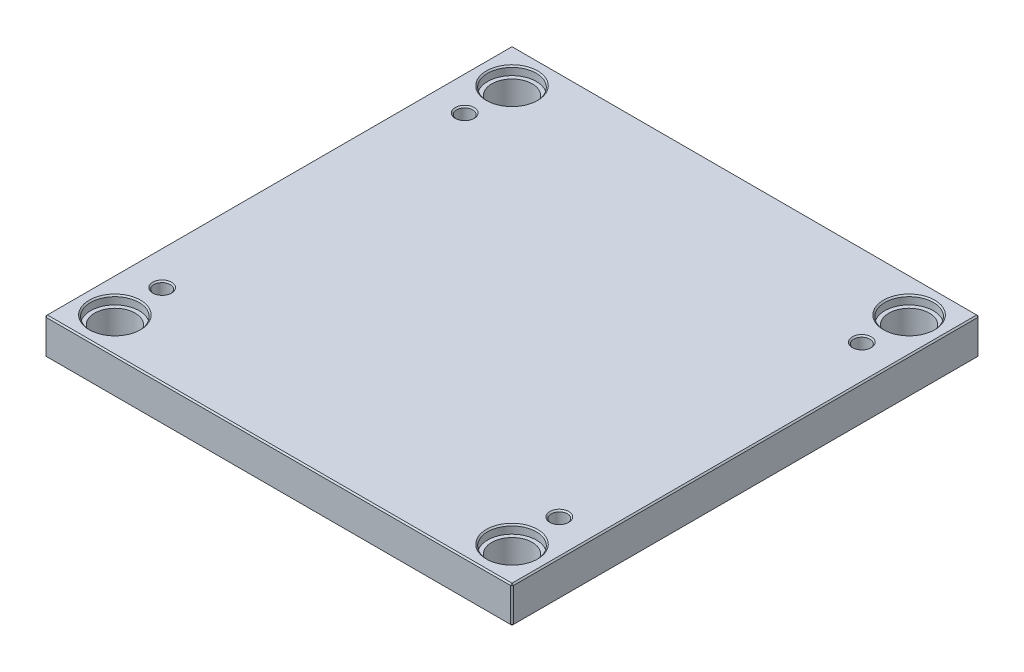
ISO-10303-21;
HEADER;
FILE_DESCRIPTION(('STEP AP214'),'2;1');
FILE_NAME('part.step','',(''),(''),'','','');
FILE_SCHEMA(('AUTOMOTIVE_DESIGN { 1 0 10303 214 1 1 1 1 }'));
ENDSEC;
DATA;
#1=APPLICATION_CONTEXT('core data for automotive mechanical design processes');
#2=APPLICATION_PROTOCOL_DEFINITION('international standard','automotive_design',2000,#1);
#3=PRODUCT_CONTEXT('',#1,'mechanical');
#4=PRODUCT('Part','Part','',(#3));
#5=PRODUCT_RELATED_PRODUCT_CATEGORY('part','',(#4));
#6=PRODUCT_DEFINITION_FORMATION('','',#4);
#7=PRODUCT_DEFINITION_CONTEXT('part definition',#1,'design');
#8=PRODUCT_DEFINITION('design','',#6,#7);
#9=PRODUCT_DEFINITION_SHAPE('','',#8);
#10=(LENGTH_UNIT() NAMED_UNIT(*) SI_UNIT(.MILLI.,.METRE.));
#11=(NAMED_UNIT(*) PLANE_ANGLE_UNIT() SI_UNIT($,.RADIAN.));
#12=(NAMED_UNIT(*) SI_UNIT($,.STERADIAN.) SOLID_ANGLE_UNIT());
#13=UNCERTAINTY_MEASURE_WITH_UNIT(LENGTH_MEASURE(1.E-05),#10,'distance_accuracy_value','');
#14=(GEOMETRIC_REPRESENTATION_CONTEXT(3) GLOBAL_UNCERTAINTY_ASSIGNED_CONTEXT((#13)) GLOBAL_UNIT_ASSIGNED_CONTEXT((#10,
#11,#12)) REPRESENTATION_CONTEXT('',''));
#15=CARTESIAN_POINT('',(0.,0.,0.));
#16=DIRECTION('',(0.,0.,1.));
#17=DIRECTION('',(1.,0.,0.));
#18=AXIS2_PLACEMENT_3D('',#15,#16,#17);
#19=CARTESIAN_POINT('',(-147.,0.,-147.));
#20=DIRECTION('',(0.,1.,0.));
#21=DIRECTION('',(0.,0.,1.));
#22=AXIS2_PLACEMENT_3D('',#19,#20,#21);
#23=CYLINDRICAL_SURFACE('',#22,15.);
#24=CARTESIAN_POINT('',(-147.,0.999999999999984,-147.));
#25=DIRECTION('',(0.,1.,0.));
#26=DIRECTION('',(0.,0.,1.));
#27=AXIS2_PLACEMENT_3D('',#24,#25,#26);
#28=CIRCLE('',#27,15.);
#29=CARTESIAN_POINT('',(-147.,0.999999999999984,-132.));
#30=VERTEX_POINT('',#29);
#31=EDGE_CURVE('E472',#30,#30,#28,.F.);
#32=ORIENTED_EDGE('',*,*,#31,.T.);
#33=EDGE_LOOP('',(#32));
#34=FACE_BOUND('',#33,.T.);
#35=CARTESIAN_POINT('',(-147.,20.7,-147.));
#36=DIRECTION('',(0.,1.,0.));
#37=DIRECTION('',(0.,0.,1.));
#38=AXIS2_PLACEMENT_3D('',#35,#36,#37);
#39=CIRCLE('',#38,15.);
#40=CARTESIAN_POINT('',(-147.,20.7,-132.));
#41=VERTEX_POINT('',#40);
#42=EDGE_CURVE('E221',#41,#41,#39,.F.);
#43=ORIENTED_EDGE('',*,*,#42,.F.);
#44=EDGE_LOOP('',(#43));
#45=FACE_BOUND('',#44,.T.);
#46=ADVANCED_FACE('F16',(#34,#45),#23,.F.);
#47=CARTESIAN_POINT('',(147.,0.,-147.));
#48=DIRECTION('',(0.,1.,0.));
#49=DIRECTION('',(0.,0.,1.));
#50=AXIS2_PLACEMENT_3D('',#47,#48,#49);
#51=CYLINDRICAL_SURFACE('',#50,15.);
#52=CARTESIAN_POINT('',(147.,0.999999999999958,-147.));
#53=DIRECTION('',(0.,1.,0.));
#54=DIRECTION('',(0.,0.,1.));
#55=AXIS2_PLACEMENT_3D('',#52,#53,#54);
#56=CIRCLE('',#55,15.);
#57=CARTESIAN_POINT('',(147.,0.999999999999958,-132.));
#58=VERTEX_POINT('',#57);
#59=EDGE_CURVE('E474',#58,#58,#56,.F.);
#60=ORIENTED_EDGE('',*,*,#59,.T.);
#61=EDGE_LOOP('',(#60));
#62=FACE_BOUND('',#61,.T.);
#63=CARTESIAN_POINT('',(147.,20.7,-147.));
#64=DIRECTION('',(0.,1.,0.));
#65=DIRECTION('',(0.,0.,1.));
#66=AXIS2_PLACEMENT_3D('',#63,#64,#65);
#67=CIRCLE('',#66,15.);
#68=CARTESIAN_POINT('',(147.,20.7,-132.));
#69=VERTEX_POINT('',#68);
#70=EDGE_CURVE('E218',#69,#69,#67,.F.);
#71=ORIENTED_EDGE('',*,*,#70,.F.);
#72=EDGE_LOOP('',(#71));
#73=FACE_BOUND('',#72,.T.);
#74=ADVANCED_FACE('F263',(#62,#73),#51,.F.);
#75=CARTESIAN_POINT('',(147.,0.,147.));
#76=DIRECTION('',(0.,1.,0.));
#77=DIRECTION('',(0.,0.,1.));
#78=AXIS2_PLACEMENT_3D('',#75,#76,#77);
#79=CYLINDRICAL_SURFACE('',#78,15.);
#80=CARTESIAN_POINT('',(147.,0.999999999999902,147.));
#81=DIRECTION('',(0.,1.,0.));
#82=DIRECTION('',(0.,0.,1.));
#83=AXIS2_PLACEMENT_3D('',#80,#81,#82);
#84=CIRCLE('',#83,15.);
#85=CARTESIAN_POINT('',(147.,0.999999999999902,162.));
#86=VERTEX_POINT('',#85);
#87=EDGE_CURVE('E477',#86,#86,#84,.F.);
#88=ORIENTED_EDGE('',*,*,#87,.T.);
#89=EDGE_LOOP('',(#88));
#90=FACE_BOUND('',#89,.T.);
#91=CARTESIAN_POINT('',(147.,20.7,147.));
#92=DIRECTION('',(0.,1.,0.));
#93=DIRECTION('',(0.,0.,1.));
#94=AXIS2_PLACEMENT_3D('',#91,#92,#93);
#95=CIRCLE('',#94,15.);
#96=CARTESIAN_POINT('',(147.,20.7,162.));
#97=VERTEX_POINT('',#96);
#98=EDGE_CURVE('E214',#97,#97,#95,.F.);
#99=ORIENTED_EDGE('',*,*,#98,.F.);
#100=EDGE_LOOP('',(#99));
#101=FACE_BOUND('',#100,.T.);
#102=ADVANCED_FACE('F270',(#90,#101),#79,.F.);
#103=CARTESIAN_POINT('',(-147.,0.,147.));
#104=DIRECTION('',(0.,1.,0.));
#105=DIRECTION('',(0.,0.,1.));
#106=AXIS2_PLACEMENT_3D('',#103,#104,#105);
#107=CYLINDRICAL_SURFACE('',#106,15.);
#108=CARTESIAN_POINT('',(-147.,0.999999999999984,147.));
#109=DIRECTION('',(0.,1.,0.));
#110=DIRECTION('',(0.,0.,1.));
#111=AXIS2_PLACEMENT_3D('',#108,#109,#110);
#112=CIRCLE('',#111,15.);
#113=CARTESIAN_POINT('',(-147.,0.999999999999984,162.));
#114=VERTEX_POINT('',#113);
#115=EDGE_CURVE('E480',#114,#114,#112,.F.);
#116=ORIENTED_EDGE('',*,*,#115,.T.);
#117=EDGE_LOOP('',(#116));
#118=FACE_BOUND('',#117,.T.);
#119=CARTESIAN_POINT('',(-147.,20.7,147.));
#120=DIRECTION('',(0.,1.,0.));
#121=DIRECTION('',(0.,0.,1.));
#122=AXIS2_PLACEMENT_3D('',#119,#120,#121);
#123=CIRCLE('',#122,15.);
#124=CARTESIAN_POINT('',(-147.,20.7,162.));
#125=VERTEX_POINT('',#124);
#126=EDGE_CURVE('E211',#125,#125,#123,.F.);
#127=ORIENTED_EDGE('',*,*,#126,.F.);
#128=EDGE_LOOP('',(#127));
#129=FACE_BOUND('',#128,.T.);
#130=ADVANCED_FACE('F277',(#118,#129),#107,.F.);
#131=CARTESIAN_POINT('',(-173.,27.,173.));
#132=DIRECTION('',(1.,0.,0.));
#133=DIRECTION('',(0.,0.,-1.));
#134=AXIS2_PLACEMENT_3D('',#131,#132,#133);
#135=PLANE('',#134);
#136=DIRECTION('',(0.,-1.,0.));
#137=VECTOR('',#136,1.);
#138=CARTESIAN_POINT('',(-173.,27.,-172.));
#139=LINE('',#138,#137);
#140=CARTESIAN_POINT('',(-173.,26.,-172.));
#141=VERTEX_POINT('',#140);
#142=CARTESIAN_POINT('',(-173.,0.999999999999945,-172.));
#143=VERTEX_POINT('',#142);
#144=EDGE_CURVE('E487',#141,#143,#139,.T.);
#145=ORIENTED_EDGE('',*,*,#144,.T.);
#146=DIRECTION('',(0.,0.,1.));
#147=VECTOR('',#146,1.);
#148=CARTESIAN_POINT('',(-173.,0.999999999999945,173.));
#149=LINE('',#148,#147);
#150=CARTESIAN_POINT('',(-173.,0.999999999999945,172.));
#151=VERTEX_POINT('',#150);
#152=EDGE_CURVE('E490',#143,#151,#149,.T.);
#153=ORIENTED_EDGE('',*,*,#152,.T.);
#154=DIRECTION('',(0.,1.,0.));
#155=VECTOR('',#154,1.);
#156=CARTESIAN_POINT('',(-173.,27.,172.));
#157=LINE('',#156,#155);
#158=CARTESIAN_POINT('',(-173.,26.,172.));
#159=VERTEX_POINT('',#158);
#160=EDGE_CURVE('E485',#151,#159,#157,.T.);
#161=ORIENTED_EDGE('',*,*,#160,.T.);
#162=DIRECTION('',(0.,0.,-1.));
#163=VECTOR('',#162,1.);
#164=CARTESIAN_POINT('',(-173.,26.,-173.));
#165=LINE('',#164,#163);
#166=EDGE_CURVE('E483',#159,#141,#165,.T.);
#167=ORIENTED_EDGE('',*,*,#166,.T.);
#168=EDGE_LOOP('',(#145,#153,#161,#167));
#169=FACE_BOUND('',#168,.T.);
#170=ADVANCED_FACE('F298',(#169),#135,.F.);
#171=CARTESIAN_POINT('',(173.,27.,173.));
#172=DIRECTION('',(0.,0.,-1.));
#173=DIRECTION('',(-1.,0.,0.));
#174=AXIS2_PLACEMENT_3D('',#171,#172,#173);
#175=PLANE('',#174);
#176=DIRECTION('',(-1.,0.,0.));
#177=VECTOR('',#176,1.);
#178=CARTESIAN_POINT('',(-173.,26.,173.));
#179=LINE('',#178,#177);
#180=CARTESIAN_POINT('',(172.,26.,173.));
#181=VERTEX_POINT('',#180);
#182=CARTESIAN_POINT('',(-172.,26.,173.));
#183=VERTEX_POINT('',#182);
#184=EDGE_CURVE('E509',#181,#183,#179,.T.);
#185=ORIENTED_EDGE('',*,*,#184,.T.);
#186=DIRECTION('',(0.,-1.,0.));
#187=VECTOR('',#186,1.);
#188=CARTESIAN_POINT('',(-172.,27.,173.));
#189=LINE('',#188,#187);
#190=CARTESIAN_POINT('',(-172.,1.,173.));
#191=VERTEX_POINT('',#190);
#192=EDGE_CURVE('E515',#183,#191,#189,.T.);
#193=ORIENTED_EDGE('',*,*,#192,.T.);
#194=DIRECTION('',(1.,0.,0.));
#195=VECTOR('',#194,1.);
#196=CARTESIAN_POINT('',(173.,1.,173.));
#197=LINE('',#196,#195);
#198=CARTESIAN_POINT('',(172.,1.,173.));
#199=VERTEX_POINT('',#198);
#200=EDGE_CURVE('E513',#191,#199,#197,.T.);
#201=ORIENTED_EDGE('',*,*,#200,.T.);
#202=DIRECTION('',(0.,1.,0.));
#203=VECTOR('',#202,1.);
#204=CARTESIAN_POINT('',(172.,27.,173.));
#205=LINE('',#204,#203);
#206=EDGE_CURVE('E511',#199,#181,#205,.T.);
#207=ORIENTED_EDGE('',*,*,#206,.T.);
#208=EDGE_LOOP('',(#185,#193,#201,#207));
#209=FACE_BOUND('',#208,.T.);
#210=ADVANCED_FACE('F294',(#209),#175,.F.);
#211=CARTESIAN_POINT('',(173.,27.,173.));
#212=DIRECTION('',(-1.,0.,0.));
#213=DIRECTION('',(0.,0.,1.));
#214=AXIS2_PLACEMENT_3D('',#211,#212,#213);
#215=PLANE('',#214);
#216=DIRECTION('',(0.,0.,-1.));
#217=VECTOR('',#216,1.);
#218=CARTESIAN_POINT('',(173.,1.,173.));
#219=LINE('',#218,#217);
#220=CARTESIAN_POINT('',(173.,1.,172.));
#221=VERTEX_POINT('',#220);
#222=CARTESIAN_POINT('',(173.,1.,-172.));
#223=VERTEX_POINT('',#222);
#224=EDGE_CURVE('E504',#221,#223,#219,.T.);
#225=ORIENTED_EDGE('',*,*,#224,.T.);
#226=DIRECTION('',(0.,1.,0.));
#227=VECTOR('',#226,1.);
#228=CARTESIAN_POINT('',(173.,27.,-172.));
#229=LINE('',#228,#227);
#230=CARTESIAN_POINT('',(173.,26.,-172.));
#231=VERTEX_POINT('',#230);
#232=EDGE_CURVE('E506',#223,#231,#229,.T.);
#233=ORIENTED_EDGE('',*,*,#232,.T.);
#234=DIRECTION('',(0.,0.,1.));
#235=VECTOR('',#234,1.);
#236=CARTESIAN_POINT('',(173.,26.,173.));
#237=LINE('',#236,#235);
#238=CARTESIAN_POINT('',(173.,26.,172.));
#239=VERTEX_POINT('',#238);
#240=EDGE_CURVE('E500',#231,#239,#237,.T.);
#241=ORIENTED_EDGE('',*,*,#240,.T.);
#242=DIRECTION('',(0.,-1.,0.));
#243=VECTOR('',#242,1.);
#244=CARTESIAN_POINT('',(173.,27.,172.));
#245=LINE('',#244,#243);
#246=EDGE_CURVE('E502',#239,#221,#245,.T.);
#247=ORIENTED_EDGE('',*,*,#246,.T.);
#248=EDGE_LOOP('',(#225,#233,#241,#247));
#249=FACE_BOUND('',#248,.T.);
#250=ADVANCED_FACE('F290',(#249),#215,.F.);
#251=CARTESIAN_POINT('',(173.,27.,-173.));
#252=DIRECTION('',(0.,0.,1.));
#253=DIRECTION('',(1.,0.,0.));
#254=AXIS2_PLACEMENT_3D('',#251,#252,#253);
#255=PLANE('',#254);
#256=DIRECTION('',(0.,-1.,0.));
#257=VECTOR('',#256,1.);
#258=CARTESIAN_POINT('',(172.,27.,-173.));
#259=LINE('',#258,#257);
#260=CARTESIAN_POINT('',(172.,26.,-173.));
#261=VERTEX_POINT('',#260);
#262=CARTESIAN_POINT('',(172.,1.,-173.));
#263=VERTEX_POINT('',#262);
#264=EDGE_CURVE('E494',#261,#263,#259,.T.);
#265=ORIENTED_EDGE('',*,*,#264,.T.);
#266=DIRECTION('',(-1.,0.,0.));
#267=VECTOR('',#266,1.);
#268=CARTESIAN_POINT('',(173.,1.,-173.));
#269=LINE('',#268,#267);
#270=CARTESIAN_POINT('',(-172.,1.,-173.));
#271=VERTEX_POINT('',#270);
#272=EDGE_CURVE('E138',#263,#271,#269,.T.);
#273=ORIENTED_EDGE('',*,*,#272,.T.);
#274=DIRECTION('',(0.,1.,0.));
#275=VECTOR('',#274,1.);
#276=CARTESIAN_POINT('',(-172.,27.,-173.));
#277=LINE('',#276,#275);
#278=CARTESIAN_POINT('',(-172.,26.,-173.));
#279=VERTEX_POINT('',#278);
#280=EDGE_CURVE('E496',#271,#279,#277,.T.);
#281=ORIENTED_EDGE('',*,*,#280,.T.);
#282=DIRECTION('',(1.,0.,0.));
#283=VECTOR('',#282,1.);
#284=CARTESIAN_POINT('',(173.,26.,-173.));
#285=LINE('',#284,#283);
#286=EDGE_CURVE('E492',#279,#261,#285,.T.);
#287=ORIENTED_EDGE('',*,*,#286,.T.);
#288=EDGE_LOOP('',(#265,#273,#281,#287));
#289=FACE_BOUND('',#288,.T.);
#290=ADVANCED_FACE('F282',(#289),#255,.F.);
#291=CARTESIAN_POINT('',(0.,27.,0.));
#292=DIRECTION('',(0.,1.,0.));
#293=DIRECTION('',(0.,0.,1.));
#294=AXIS2_PLACEMENT_3D('',#291,#292,#293);
#295=PLANE('',#294);
#296=CARTESIAN_POINT('',(147.,27.,147.));
#297=DIRECTION('',(0.,1.,0.));
#298=DIRECTION('',(0.,0.,1.));
#299=AXIS2_PLACEMENT_3D('',#296,#297,#298);
#300=CIRCLE('',#299,19.);
#301=CARTESIAN_POINT('',(147.,27.,166.));
#302=VERTEX_POINT('',#301);
#303=EDGE_CURVE('E236',#302,#302,#300,.F.);
#304=ORIENTED_EDGE('',*,*,#303,.T.);
#305=EDGE_LOOP('',(#304));
#306=FACE_BOUND('',#305,.T.);
#307=CARTESIAN_POINT('',(-147.,27.,147.));
#308=DIRECTION('',(0.,1.,0.));
#309=DIRECTION('',(0.,0.,1.));
#310=AXIS2_PLACEMENT_3D('',#307,#308,#309);
#311=CIRCLE('',#310,19.);
#312=CARTESIAN_POINT('',(-147.,27.,166.));
#313=VERTEX_POINT('',#312);
#314=EDGE_CURVE('E233',#313,#313,#311,.F.);
#315=ORIENTED_EDGE('',*,*,#314,.T.);
#316=EDGE_LOOP('',(#315));
#317=FACE_BOUND('',#316,.T.);
#318=CARTESIAN_POINT('',(147.,27.,-147.));
#319=DIRECTION('',(0.,1.,0.));
#320=DIRECTION('',(0.,0.,1.));
#321=AXIS2_PLACEMENT_3D('',#318,#319,#320);
#322=CIRCLE('',#321,19.);
#323=CARTESIAN_POINT('',(147.,27.,-128.));
#324=VERTEX_POINT('',#323);
#325=EDGE_CURVE('E230',#324,#324,#322,.F.);
#326=ORIENTED_EDGE('',*,*,#325,.T.);
#327=EDGE_LOOP('',(#326));
#328=FACE_BOUND('',#327,.T.);
#329=CARTESIAN_POINT('',(-147.,27.,-147.));
#330=DIRECTION('',(0.,1.,0.));
#331=DIRECTION('',(0.,0.,1.));
#332=AXIS2_PLACEMENT_3D('',#329,#330,#331);
#333=CIRCLE('',#332,19.);
#334=CARTESIAN_POINT('',(-147.,27.,-128.));
#335=VERTEX_POINT('',#334);
#336=EDGE_CURVE('E227',#335,#335,#333,.F.);
#337=ORIENTED_EDGE('',*,*,#336,.T.);
#338=EDGE_LOOP('',(#337));
#339=FACE_BOUND('',#338,.T.);
#340=CARTESIAN_POINT('',(-147.,27.,112.));
#341=DIRECTION('',(0.,1.,0.));
#342=DIRECTION('',(0.,0.,1.));
#343=AXIS2_PLACEMENT_3D('',#340,#341,#342);
#344=CIRCLE('',#343,7.);
#345=CARTESIAN_POINT('',(-147.,27.,119.));
#346=VERTEX_POINT('',#345);
#347=EDGE_CURVE('E198',#346,#346,#344,.F.);
#348=ORIENTED_EDGE('',*,*,#347,.T.);
#349=EDGE_LOOP('',(#348));
#350=FACE_BOUND('',#349,.T.);
#351=CARTESIAN_POINT('',(147.,27.,112.));
#352=DIRECTION('',(0.,1.,0.));
#353=DIRECTION('',(0.,0.,1.));
#354=AXIS2_PLACEMENT_3D('',#351,#352,#353);
#355=CIRCLE('',#354,7.00000000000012);
#356=CARTESIAN_POINT('',(147.,27.,119.));
#357=VERTEX_POINT('',#356);
#358=EDGE_CURVE('E195',#357,#357,#355,.F.);
#359=ORIENTED_EDGE('',*,*,#358,.T.);
#360=EDGE_LOOP('',(#359));
#361=FACE_BOUND('',#360,.T.);
#362=CARTESIAN_POINT('',(147.,27.,-112.));
#363=DIRECTION('',(0.,1.,0.));
#364=DIRECTION('',(0.,0.,1.));
#365=AXIS2_PLACEMENT_3D('',#362,#363,#364);
#366=CIRCLE('',#365,7.00000000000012);
#367=CARTESIAN_POINT('',(147.,27.,-105.));
#368=VERTEX_POINT('',#367);
#369=EDGE_CURVE('E192',#368,#368,#366,.F.);
#370=ORIENTED_EDGE('',*,*,#369,.T.);
#371=EDGE_LOOP('',(#370));
#372=FACE_BOUND('',#371,.T.);
#373=CARTESIAN_POINT('',(-147.,27.,-112.));
#374=DIRECTION('',(0.,1.,0.));
#375=DIRECTION('',(0.,0.,1.));
#376=AXIS2_PLACEMENT_3D('',#373,#374,#375);
#377=CIRCLE('',#376,7.00000000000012);
#378=CARTESIAN_POINT('',(-147.,27.,-105.));
#379=VERTEX_POINT('',#378);
#380=EDGE_CURVE('E188',#379,#379,#377,.F.);
#381=ORIENTED_EDGE('',*,*,#380,.T.);
#382=EDGE_LOOP('',(#381));
#383=FACE_BOUND('',#382,.T.);
#384=DIRECTION('',(0.,0.,-1.));
#385=VECTOR('',#384,1.);
#386=CARTESIAN_POINT('',(172.,27.,-173.));
#387=LINE('',#386,#385);
#388=CARTESIAN_POINT('',(172.,27.,172.));
#389=VERTEX_POINT('',#388);
#390=CARTESIAN_POINT('',(172.,27.,-172.));
#391=VERTEX_POINT('',#390);
#392=EDGE_CURVE('E31',#389,#391,#387,.T.);
#393=ORIENTED_EDGE('',*,*,#392,.T.);
#394=DIRECTION('',(-1.,0.,0.));
#395=VECTOR('',#394,1.);
#396=CARTESIAN_POINT('',(-173.,27.,-172.));
#397=LINE('',#396,#395);
#398=CARTESIAN_POINT('',(-172.,27.,-172.));
#399=VERTEX_POINT('',#398);
#400=EDGE_CURVE('E189',#391,#399,#397,.T.);
#401=ORIENTED_EDGE('',*,*,#400,.T.);
#402=DIRECTION('',(0.,0.,1.));
#403=VECTOR('',#402,1.);
#404=CARTESIAN_POINT('',(-172.,27.,173.));
#405=LINE('',#404,#403);
#406=CARTESIAN_POINT('',(-172.,27.,172.));
#407=VERTEX_POINT('',#406);
#408=EDGE_CURVE('E518',#399,#407,#405,.T.);
#409=ORIENTED_EDGE('',*,*,#408,.T.);
#410=DIRECTION('',(1.,0.,0.));
#411=VECTOR('',#410,1.);
#412=CARTESIAN_POINT('',(173.,27.,172.));
#413=LINE('',#412,#411);
#414=EDGE_CURVE('E36',#407,#389,#413,.T.);
#415=ORIENTED_EDGE('',*,*,#414,.T.);
#416=EDGE_LOOP('',(#393,#401,#409,#415));
#417=FACE_BOUND('',#416,.T.);
#418=ADVANCED_FACE('F279',(#306,#317,#328,#339,#350,#361,#372,#383,#417),#295,.T.);
#419=CARTESIAN_POINT('',(0.,0.,0.));
#420=DIRECTION('',(0.,1.,0.));
#421=DIRECTION('',(0.,0.,1.));
#422=AXIS2_PLACEMENT_3D('',#419,#420,#421);
#423=PLANE('',#422);
#424=CARTESIAN_POINT('',(-147.,0.,-147.));
#425=DIRECTION('',(0.,1.,0.));
#426=DIRECTION('',(0.,0.,1.));
#427=AXIS2_PLACEMENT_3D('',#424,#425,#426);
#428=CIRCLE('',#427,16.);
#429=CARTESIAN_POINT('',(-147.,0.,-131.));
#430=VERTEX_POINT('',#429);
#431=EDGE_CURVE('E469',#430,#430,#428,.T.);
#432=ORIENTED_EDGE('',*,*,#431,.T.);
#433=EDGE_LOOP('',(#432));
#434=FACE_BOUND('',#433,.T.);
#435=CARTESIAN_POINT('',(147.,0.,-147.));
#436=DIRECTION('',(0.,1.,0.));
#437=DIRECTION('',(0.,0.,1.));
#438=AXIS2_PLACEMENT_3D('',#435,#436,#437);
#439=CIRCLE('',#438,16.);
#440=CARTESIAN_POINT('',(147.,0.,-131.));
#441=VERTEX_POINT('',#440);
#442=EDGE_CURVE('E466',#441,#441,#439,.T.);
#443=ORIENTED_EDGE('',*,*,#442,.T.);
#444=EDGE_LOOP('',(#443));
#445=FACE_BOUND('',#444,.T.);
#446=CARTESIAN_POINT('',(147.,0.,147.));
#447=DIRECTION('',(0.,1.,0.));
#448=DIRECTION('',(0.,0.,1.));
#449=AXIS2_PLACEMENT_3D('',#446,#447,#448);
#450=CIRCLE('',#449,16.);
#451=CARTESIAN_POINT('',(147.,0.,163.));
#452=VERTEX_POINT('',#451);
#453=EDGE_CURVE('E463',#452,#452,#450,.T.);
#454=ORIENTED_EDGE('',*,*,#453,.T.);
#455=EDGE_LOOP('',(#454));
#456=FACE_BOUND('',#455,.T.);
#457=CARTESIAN_POINT('',(-147.,0.,147.));
#458=DIRECTION('',(0.,1.,0.));
#459=DIRECTION('',(0.,0.,1.));
#460=AXIS2_PLACEMENT_3D('',#457,#458,#459);
#461=CIRCLE('',#460,16.);
#462=CARTESIAN_POINT('',(-147.,0.,163.));
#463=VERTEX_POINT('',#462);
#464=EDGE_CURVE('E460',#463,#463,#461,.T.);
#465=ORIENTED_EDGE('',*,*,#464,.T.);
#466=EDGE_LOOP('',(#465));
#467=FACE_BOUND('',#466,.T.);
#468=DIRECTION('',(0.,0.,1.));
#469=VECTOR('',#468,1.);
#470=CARTESIAN_POINT('',(172.,0.,0.));
#471=LINE('',#470,#469);
#472=CARTESIAN_POINT('',(172.,0.,-172.));
#473=VERTEX_POINT('',#472);
#474=CARTESIAN_POINT('',(172.,0.,172.));
#475=VERTEX_POINT('',#474);
#476=EDGE_CURVE('E108',#473,#475,#471,.T.);
#477=ORIENTED_EDGE('',*,*,#476,.T.);
#478=DIRECTION('',(-1.,0.,0.));
#479=VECTOR('',#478,1.);
#480=CARTESIAN_POINT('',(0.,0.,172.));
#481=LINE('',#480,#479);
#482=CARTESIAN_POINT('',(-172.,0.,172.));
#483=VERTEX_POINT('',#482);
#484=EDGE_CURVE('E458',#475,#483,#481,.T.);
#485=ORIENTED_EDGE('',*,*,#484,.T.);
#486=DIRECTION('',(0.,0.,-1.));
#487=VECTOR('',#486,1.);
#488=CARTESIAN_POINT('',(-172.,0.,0.));
#489=LINE('',#488,#487);
#490=CARTESIAN_POINT('',(-172.,0.,-172.));
#491=VERTEX_POINT('',#490);
#492=EDGE_CURVE('E110',#483,#491,#489,.T.);
#493=ORIENTED_EDGE('',*,*,#492,.T.);
#494=DIRECTION('',(1.,0.,0.));
#495=VECTOR('',#494,1.);
#496=CARTESIAN_POINT('',(0.,0.,-172.));
#497=LINE('',#496,#495);
#498=EDGE_CURVE('E104',#491,#473,#497,.T.);
#499=ORIENTED_EDGE('',*,*,#498,.T.);
#500=EDGE_LOOP('',(#477,#485,#493,#499));
#501=FACE_BOUND('',#500,.T.);
#502=ADVANCED_FACE('F106',(#434,#445,#456,#467,#501),#423,.F.);
#503=CARTESIAN_POINT('',(-147.,0.,-147.));
#504=DIRECTION('',(0.,-1.,0.));
#505=DIRECTION('',(0.,0.,-1.));
#506=AXIS2_PLACEMENT_3D('',#503,#504,#505);
#507=CONICAL_SURFACE('',#506,16.,0.785398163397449);
#508=ORIENTED_EDGE('',*,*,#31,.F.);
#509=EDGE_LOOP('',(#508));
#510=FACE_BOUND('',#509,.T.);
#511=ORIENTED_EDGE('',*,*,#431,.F.);
#512=EDGE_LOOP('',(#511));
#513=FACE_BOUND('',#512,.T.);
#514=ADVANCED_FACE('F286',(#510,#513),#507,.F.);
#515=CARTESIAN_POINT('',(147.,0.,-147.));
#516=DIRECTION('',(0.,-1.,0.));
#517=DIRECTION('',(0.,0.,-1.));
#518=AXIS2_PLACEMENT_3D('',#515,#516,#517);
#519=CONICAL_SURFACE('',#518,16.,0.785398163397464);
#520=ORIENTED_EDGE('',*,*,#59,.F.);
#521=EDGE_LOOP('',(#520));
#522=FACE_BOUND('',#521,.T.);
#523=ORIENTED_EDGE('',*,*,#442,.F.);
#524=EDGE_LOOP('',(#523));
#525=FACE_BOUND('',#524,.T.);
#526=ADVANCED_FACE('F305',(#522,#525),#519,.F.);
#527=CARTESIAN_POINT('',(147.,0.,147.));
#528=DIRECTION('',(0.,-1.,0.));
#529=DIRECTION('',(0.,0.,-1.));
#530=AXIS2_PLACEMENT_3D('',#527,#528,#529);
#531=CONICAL_SURFACE('',#530,16.,0.78539816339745);
#532=ORIENTED_EDGE('',*,*,#87,.F.);
#533=EDGE_LOOP('',(#532));
#534=FACE_BOUND('',#533,.T.);
#535=ORIENTED_EDGE('',*,*,#453,.F.);
#536=EDGE_LOOP('',(#535));
#537=FACE_BOUND('',#536,.T.);
#538=ADVANCED_FACE('F309',(#534,#537),#531,.F.);
#539=CARTESIAN_POINT('',(-147.,0.,147.));
#540=DIRECTION('',(0.,-1.,0.));
#541=DIRECTION('',(0.,0.,-1.));
#542=AXIS2_PLACEMENT_3D('',#539,#540,#541);
#543=CONICAL_SURFACE('',#542,16.,0.785398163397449);
#544=ORIENTED_EDGE('',*,*,#115,.F.);
#545=EDGE_LOOP('',(#544));
#546=FACE_BOUND('',#545,.T.);
#547=ORIENTED_EDGE('',*,*,#464,.F.);
#548=EDGE_LOOP('',(#547));
#549=FACE_BOUND('',#548,.T.);
#550=ADVANCED_FACE('F313',(#546,#549),#543,.F.);
#551=CARTESIAN_POINT('',(173.,27.,172.));
#552=DIRECTION('',(-0.707106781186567,0.,-0.707106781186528));
#553=DIRECTION('',(0.,-1.,0.));
#554=AXIS2_PLACEMENT_3D('',#551,#552,#553);
#555=PLANE('',#554);
#556=DIRECTION('',(-0.707106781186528,0.,0.707106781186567));
#557=VECTOR('',#556,1.);
#558=CARTESIAN_POINT('',(172.,26.,173.));
#559=LINE('',#558,#557);
#560=EDGE_CURVE('E126',#181,#239,#559,.F.);
#561=ORIENTED_EDGE('',*,*,#560,.F.);
#562=ORIENTED_EDGE('',*,*,#206,.F.);
#563=DIRECTION('',(0.707106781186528,0.,-0.707106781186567));
#564=VECTOR('',#563,1.);
#565=CARTESIAN_POINT('',(172.,1.,173.));
#566=LINE('',#565,#564);
#567=EDGE_CURVE('E180',#221,#199,#566,.F.);
#568=ORIENTED_EDGE('',*,*,#567,.F.);
#569=ORIENTED_EDGE('',*,*,#246,.F.);
#570=EDGE_LOOP('',(#561,#562,#568,#569));
#571=FACE_BOUND('',#570,.T.);
#572=ADVANCED_FACE('F317',(#571),#555,.F.);
#573=CARTESIAN_POINT('',(172.,26.,173.));
#574=DIRECTION('',(0.57735026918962,0.577350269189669,0.577350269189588));
#575=DIRECTION('',(-0.707106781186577,0.707106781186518,0.));
#576=AXIS2_PLACEMENT_3D('',#573,#574,#575);
#577=PLANE('',#576);
#578=DIRECTION('',(0.,-0.707106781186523,0.707106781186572));
#579=VECTOR('',#578,1.);
#580=CARTESIAN_POINT('',(172.,26.,173.));
#581=LINE('',#580,#579);
#582=EDGE_CURVE('E175',#181,#389,#581,.F.);
#583=ORIENTED_EDGE('',*,*,#582,.F.);
#584=ORIENTED_EDGE('',*,*,#560,.T.);
#585=DIRECTION('',(-0.707106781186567,0.707106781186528,0.));
#586=VECTOR('',#585,1.);
#587=CARTESIAN_POINT('',(172.5,26.5,172.));
#588=LINE('',#587,#586);
#589=EDGE_CURVE('E177',#389,#239,#588,.F.);
#590=ORIENTED_EDGE('',*,*,#589,.F.);
#591=EDGE_LOOP('',(#583,#584,#590));
#592=FACE_BOUND('',#591,.T.);
#593=ADVANCED_FACE('F385',(#592),#577,.T.);
#594=CARTESIAN_POINT('',(172.,1.,173.));
#595=DIRECTION('',(0.577350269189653,-0.577350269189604,0.57735026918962));
#596=DIRECTION('',(0.707106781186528,0.,-0.707106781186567));
#597=AXIS2_PLACEMENT_3D('',#594,#595,#596);
#598=PLANE('',#597);
#599=DIRECTION('',(-0.707106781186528,-0.707106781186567,0.));
#600=VECTOR('',#599,1.);
#601=CARTESIAN_POINT('',(172.5,0.500000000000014,172.));
#602=LINE('',#601,#600);
#603=EDGE_CURVE('E124',#221,#475,#602,.T.);
#604=ORIENTED_EDGE('',*,*,#603,.F.);
#605=ORIENTED_EDGE('',*,*,#567,.T.);
#606=DIRECTION('',(0.,0.707106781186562,0.707106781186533));
#607=VECTOR('',#606,1.);
#608=CARTESIAN_POINT('',(172.,1.,173.));
#609=LINE('',#608,#607);
#610=EDGE_CURVE('E172',#475,#199,#609,.T.);
#611=ORIENTED_EDGE('',*,*,#610,.F.);
#612=EDGE_LOOP('',(#604,#605,#611));
#613=FACE_BOUND('',#612,.T.);
#614=ADVANCED_FACE('F381',(#613),#598,.T.);
#615=CARTESIAN_POINT('',(172.,27.,0.));
#616=DIRECTION('',(0.707106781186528,0.707106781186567,0.));
#617=DIRECTION('',(0.,0.,1.));
#618=AXIS2_PLACEMENT_3D('',#615,#616,#617);
#619=PLANE('',#618);
#620=ORIENTED_EDGE('',*,*,#589,.T.);
#621=ORIENTED_EDGE('',*,*,#240,.F.);
#622=DIRECTION('',(0.707106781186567,-0.707106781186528,0.));
#623=VECTOR('',#622,1.);
#624=CARTESIAN_POINT('',(173.,26.,-172.));
#625=LINE('',#624,#623);
#626=EDGE_CURVE('E166',#391,#231,#625,.T.);
#627=ORIENTED_EDGE('',*,*,#626,.F.);
#628=ORIENTED_EDGE('',*,*,#392,.F.);
#629=EDGE_LOOP('',(#620,#621,#627,#628));
#630=FACE_BOUND('',#629,.T.);
#631=ADVANCED_FACE('F377',(#630),#619,.T.);
#632=CARTESIAN_POINT('',(0.,27.,172.));
#633=DIRECTION('',(0.,0.707106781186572,0.707106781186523));
#634=DIRECTION('',(-1.,0.,0.));
#635=AXIS2_PLACEMENT_3D('',#632,#633,#634);
#636=PLANE('',#635);
#637=ORIENTED_EDGE('',*,*,#582,.T.);
#638=ORIENTED_EDGE('',*,*,#414,.F.);
#639=DIRECTION('',(0.,0.707106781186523,-0.707106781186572));
#640=VECTOR('',#639,1.);
#641=CARTESIAN_POINT('',(-172.,26.5,172.5));
#642=LINE('',#641,#640);
#643=EDGE_CURVE('E163',#183,#407,#642,.T.);
#644=ORIENTED_EDGE('',*,*,#643,.F.);
#645=ORIENTED_EDGE('',*,*,#184,.F.);
#646=EDGE_LOOP('',(#637,#638,#644,#645));
#647=FACE_BOUND('',#646,.T.);
#648=ADVANCED_FACE('F373',(#647),#636,.T.);
#649=CARTESIAN_POINT('',(-172.,27.,173.));
#650=DIRECTION('',(0.707106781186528,0.,-0.707106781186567));
#651=DIRECTION('',(0.,-1.,0.));
#652=AXIS2_PLACEMENT_3D('',#649,#650,#651);
#653=PLANE('',#652);
#654=DIRECTION('',(0.707106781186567,0.,0.707106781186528));
#655=VECTOR('',#654,1.);
#656=CARTESIAN_POINT('',(-172.,1.,173.));
#657=LINE('',#656,#655);
#658=EDGE_CURVE('E157',#191,#151,#657,.F.);
#659=ORIENTED_EDGE('',*,*,#658,.F.);
#660=ORIENTED_EDGE('',*,*,#192,.F.);
#661=DIRECTION('',(-0.707106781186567,0.,-0.707106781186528));
#662=VECTOR('',#661,1.);
#663=CARTESIAN_POINT('',(-173.,26.,172.));
#664=LINE('',#663,#662);
#665=EDGE_CURVE('E160',#159,#183,#664,.F.);
#666=ORIENTED_EDGE('',*,*,#665,.F.);
#667=ORIENTED_EDGE('',*,*,#160,.F.);
#668=EDGE_LOOP('',(#659,#660,#666,#667));
#669=FACE_BOUND('',#668,.T.);
#670=ADVANCED_FACE('F369',(#669),#653,.F.);
#671=CARTESIAN_POINT('',(173.,1.,173.));
#672=DIRECTION('',(0.,0.707106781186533,-0.707106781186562));
#673=DIRECTION('',(1.,0.,0.));
#674=AXIS2_PLACEMENT_3D('',#671,#672,#673);
#675=PLANE('',#674);
#676=ORIENTED_EDGE('',*,*,#610,.T.);
#677=ORIENTED_EDGE('',*,*,#200,.F.);
#678=DIRECTION('',(0.,-0.707106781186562,-0.707106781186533));
#679=VECTOR('',#678,1.);
#680=CARTESIAN_POINT('',(-172.,1.,173.));
#681=LINE('',#680,#679);
#682=EDGE_CURVE('E135',#483,#191,#681,.F.);
#683=ORIENTED_EDGE('',*,*,#682,.F.);
#684=ORIENTED_EDGE('',*,*,#484,.F.);
#685=EDGE_LOOP('',(#676,#677,#683,#684));
#686=FACE_BOUND('',#685,.T.);
#687=ADVANCED_FACE('F366',(#686),#675,.F.);
#688=CARTESIAN_POINT('',(173.,1.,173.));
#689=DIRECTION('',(-0.707106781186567,0.707106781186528,0.));
#690=DIRECTION('',(0.,0.,-1.));
#691=AXIS2_PLACEMENT_3D('',#688,#689,#690);
#692=PLANE('',#691);
#693=ORIENTED_EDGE('',*,*,#603,.T.);
#694=ORIENTED_EDGE('',*,*,#476,.F.);
#695=DIRECTION('',(0.707106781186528,0.707106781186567,0.));
#696=VECTOR('',#695,1.);
#697=CARTESIAN_POINT('',(172.5,0.499999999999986,-172.));
#698=LINE('',#697,#696);
#699=EDGE_CURVE('E121',#223,#473,#698,.F.);
#700=ORIENTED_EDGE('',*,*,#699,.F.);
#701=ORIENTED_EDGE('',*,*,#224,.F.);
#702=EDGE_LOOP('',(#693,#694,#700,#701));
#703=FACE_BOUND('',#702,.T.);
#704=ADVANCED_FACE('F119',(#703),#692,.F.);
#705=CARTESIAN_POINT('',(172.,27.,-173.));
#706=DIRECTION('',(-0.707106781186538,0.,0.707106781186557));
#707=DIRECTION('',(0.,-1.,0.));
#708=AXIS2_PLACEMENT_3D('',#705,#706,#707);
#709=PLANE('',#708);
#710=DIRECTION('',(0.707106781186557,0.,0.707106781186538));
#711=VECTOR('',#710,1.);
#712=CARTESIAN_POINT('',(173.,26.,-172.));
#713=LINE('',#712,#711);
#714=EDGE_CURVE('E168',#231,#261,#713,.F.);
#715=ORIENTED_EDGE('',*,*,#714,.F.);
#716=ORIENTED_EDGE('',*,*,#232,.F.);
#717=DIRECTION('',(-0.707106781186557,0.,-0.707106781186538));
#718=VECTOR('',#717,1.);
#719=CARTESIAN_POINT('',(172.,1.,-173.));
#720=LINE('',#719,#718);
#721=EDGE_CURVE('E134',#263,#223,#720,.F.);
#722=ORIENTED_EDGE('',*,*,#721,.F.);
#723=ORIENTED_EDGE('',*,*,#264,.F.);
#724=EDGE_LOOP('',(#715,#716,#722,#723));
#725=FACE_BOUND('',#724,.T.);
#726=ADVANCED_FACE('F359',(#725),#709,.F.);
#727=CARTESIAN_POINT('',(173.,26.,-172.));
#728=DIRECTION('',(0.577350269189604,0.577350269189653,-0.57735026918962));
#729=DIRECTION('',(0.,0.707106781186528,0.707106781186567));
#730=AXIS2_PLACEMENT_3D('',#727,#728,#729);
#731=PLANE('',#730);
#732=ORIENTED_EDGE('',*,*,#626,.T.);
#733=ORIENTED_EDGE('',*,*,#714,.T.);
#734=DIRECTION('',(0.,0.707106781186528,0.707106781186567));
#735=VECTOR('',#734,1.);
#736=CARTESIAN_POINT('',(172.,26.5,-172.5));
#737=LINE('',#736,#735);
#738=EDGE_CURVE('E152',#391,#261,#737,.F.);
#739=ORIENTED_EDGE('',*,*,#738,.F.);
#740=EDGE_LOOP('',(#732,#733,#739));
#741=FACE_BOUND('',#740,.T.);
#742=ADVANCED_FACE('F355',(#741),#731,.T.);
#743=CARTESIAN_POINT('',(-173.,26.,172.));
#744=DIRECTION('',(-0.577350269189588,0.577350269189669,0.57735026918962));
#745=DIRECTION('',(0.,-0.707106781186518,0.707106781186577));
#746=AXIS2_PLACEMENT_3D('',#743,#744,#745);
#747=PLANE('',#746);
#748=ORIENTED_EDGE('',*,*,#665,.T.);
#749=ORIENTED_EDGE('',*,*,#643,.T.);
#750=DIRECTION('',(-0.707106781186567,-0.707106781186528,0.));
#751=VECTOR('',#750,1.);
#752=CARTESIAN_POINT('',(-173.,26.,172.));
#753=LINE('',#752,#751);
#754=EDGE_CURVE('E143',#159,#407,#753,.F.);
#755=ORIENTED_EDGE('',*,*,#754,.F.);
#756=EDGE_LOOP('',(#748,#749,#755));
#757=FACE_BOUND('',#756,.T.);
#758=ADVANCED_FACE('F351',(#757),#747,.T.);
#759=CARTESIAN_POINT('',(-172.,1.,173.));
#760=DIRECTION('',(-0.577350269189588,-0.577350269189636,0.577350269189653));
#761=DIRECTION('',(0.,-0.707106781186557,-0.707106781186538));
#762=AXIS2_PLACEMENT_3D('',#759,#760,#761);
#763=PLANE('',#762);
#764=ORIENTED_EDGE('',*,*,#682,.T.);
#765=ORIENTED_EDGE('',*,*,#658,.T.);
#766=DIRECTION('',(-0.707106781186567,0.707106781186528,0.));
#767=VECTOR('',#766,1.);
#768=CARTESIAN_POINT('',(-172.5,0.499999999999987,172.));
#769=LINE('',#768,#767);
#770=EDGE_CURVE('E139',#483,#151,#769,.T.);
#771=ORIENTED_EDGE('',*,*,#770,.F.);
#772=EDGE_LOOP('',(#764,#765,#771));
#773=FACE_BOUND('',#772,.T.);
#774=ADVANCED_FACE('F348',(#773),#763,.T.);
#775=CARTESIAN_POINT('',(172.,1.,-173.));
#776=DIRECTION('',(0.577350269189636,-0.577350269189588,-0.577350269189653));
#777=DIRECTION('',(-0.707106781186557,0.,-0.707106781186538));
#778=AXIS2_PLACEMENT_3D('',#775,#776,#777);
#779=PLANE('',#778);
#780=ORIENTED_EDGE('',*,*,#721,.T.);
#781=ORIENTED_EDGE('',*,*,#699,.T.);
#782=DIRECTION('',(0.,-0.707106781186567,0.707106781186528));
#783=VECTOR('',#782,1.);
#784=CARTESIAN_POINT('',(172.,1.,-173.));
#785=LINE('',#784,#783);
#786=EDGE_CURVE('E131',#263,#473,#785,.T.);
#787=ORIENTED_EDGE('',*,*,#786,.F.);
#788=EDGE_LOOP('',(#780,#781,#787));
#789=FACE_BOUND('',#788,.T.);
#790=ADVANCED_FACE('F130',(#789),#779,.T.);
#791=CARTESIAN_POINT('',(0.,27.,-172.));
#792=DIRECTION('',(0.,0.707106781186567,-0.707106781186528));
#793=DIRECTION('',(1.,0.,0.));
#794=AXIS2_PLACEMENT_3D('',#791,#792,#793);
#795=PLANE('',#794);
#796=ORIENTED_EDGE('',*,*,#738,.T.);
#797=ORIENTED_EDGE('',*,*,#286,.F.);
#798=DIRECTION('',(0.,-0.707106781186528,-0.707106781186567));
#799=VECTOR('',#798,1.);
#800=CARTESIAN_POINT('',(-172.,26.,-173.));
#801=LINE('',#800,#799);
#802=EDGE_CURVE('E140',#399,#279,#801,.T.);
#803=ORIENTED_EDGE('',*,*,#802,.F.);
#804=ORIENTED_EDGE('',*,*,#400,.F.);
#805=EDGE_LOOP('',(#796,#797,#803,#804));
#806=FACE_BOUND('',#805,.T.);
#807=ADVANCED_FACE('F341',(#806),#795,.T.);
#808=CARTESIAN_POINT('',(-172.,27.,0.));
#809=DIRECTION('',(-0.707106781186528,0.707106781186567,0.));
#810=DIRECTION('',(0.,0.,-1.));
#811=AXIS2_PLACEMENT_3D('',#808,#809,#810);
#812=PLANE('',#811);
#813=ORIENTED_EDGE('',*,*,#754,.T.);
#814=ORIENTED_EDGE('',*,*,#408,.F.);
#815=DIRECTION('',(0.707106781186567,0.707106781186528,0.));
#816=VECTOR('',#815,1.);
#817=CARTESIAN_POINT('',(-172.5,26.5,-172.));
#818=LINE('',#817,#816);
#819=EDGE_CURVE('E146',#141,#399,#818,.T.);
#820=ORIENTED_EDGE('',*,*,#819,.F.);
#821=ORIENTED_EDGE('',*,*,#166,.F.);
#822=EDGE_LOOP('',(#813,#814,#820,#821));
#823=FACE_BOUND('',#822,.T.);
#824=ADVANCED_FACE('F337',(#823),#812,.T.);
#825=CARTESIAN_POINT('',(-173.,0.999999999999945,173.));
#826=DIRECTION('',(0.707106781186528,0.707106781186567,0.));
#827=DIRECTION('',(0.,0.,1.));
#828=AXIS2_PLACEMENT_3D('',#825,#826,#827);
#829=PLANE('',#828);
#830=ORIENTED_EDGE('',*,*,#770,.T.);
#831=ORIENTED_EDGE('',*,*,#152,.F.);
#832=DIRECTION('',(0.707106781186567,-0.707106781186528,0.));
#833=VECTOR('',#832,1.);
#834=CARTESIAN_POINT('',(-173.,0.999999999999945,-172.));
#835=LINE('',#834,#833);
#836=EDGE_CURVE('E529',#491,#143,#835,.F.);
#837=ORIENTED_EDGE('',*,*,#836,.F.);
#838=ORIENTED_EDGE('',*,*,#492,.F.);
#839=EDGE_LOOP('',(#830,#831,#837,#838));
#840=FACE_BOUND('',#839,.T.);
#841=ADVANCED_FACE('F334',(#840),#829,.F.);
#842=CARTESIAN_POINT('',(173.,1.,-173.));
#843=DIRECTION('',(0.,0.707106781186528,0.707106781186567));
#844=DIRECTION('',(-1.,0.,0.));
#845=AXIS2_PLACEMENT_3D('',#842,#843,#844);
#846=PLANE('',#845);
#847=ORIENTED_EDGE('',*,*,#786,.T.);
#848=ORIENTED_EDGE('',*,*,#498,.F.);
#849=DIRECTION('',(0.,0.707106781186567,-0.707106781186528));
#850=VECTOR('',#849,1.);
#851=CARTESIAN_POINT('',(-172.,0.5,-172.5));
#852=LINE('',#851,#850);
#853=EDGE_CURVE('E526',#271,#491,#852,.F.);
#854=ORIENTED_EDGE('',*,*,#853,.F.);
#855=ORIENTED_EDGE('',*,*,#272,.F.);
#856=EDGE_LOOP('',(#847,#848,#854,#855));
#857=FACE_BOUND('',#856,.T.);
#858=ADVANCED_FACE('F137',(#857),#846,.F.);
#859=CARTESIAN_POINT('',(-172.,26.,-173.));
#860=DIRECTION('',(-0.577350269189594,0.577350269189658,-0.577350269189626));
#861=DIRECTION('',(0.,0.707106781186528,0.707106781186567));
#862=AXIS2_PLACEMENT_3D('',#859,#860,#861);
#863=PLANE('',#862);
#864=ORIENTED_EDGE('',*,*,#819,.T.);
#865=ORIENTED_EDGE('',*,*,#802,.T.);
#866=DIRECTION('',(0.707106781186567,0.,-0.707106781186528));
#867=VECTOR('',#866,1.);
#868=CARTESIAN_POINT('',(-172.,26.,-173.));
#869=LINE('',#868,#867);
#870=EDGE_CURVE('E524',#141,#279,#869,.T.);
#871=ORIENTED_EDGE('',*,*,#870,.F.);
#872=EDGE_LOOP('',(#864,#865,#871));
#873=FACE_BOUND('',#872,.T.);
#874=ADVANCED_FACE('F327',(#873),#863,.T.);
#875=CARTESIAN_POINT('',(-173.,0.999999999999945,-172.));
#876=DIRECTION('',(-0.577350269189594,-0.577350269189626,-0.577350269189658));
#877=DIRECTION('',(0.,0.707106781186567,-0.707106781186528));
#878=AXIS2_PLACEMENT_3D('',#875,#876,#877);
#879=PLANE('',#878);
#880=ORIENTED_EDGE('',*,*,#853,.T.);
#881=ORIENTED_EDGE('',*,*,#836,.T.);
#882=DIRECTION('',(-0.707106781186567,0.,0.707106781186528));
#883=VECTOR('',#882,1.);
#884=CARTESIAN_POINT('',(-173.,0.999999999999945,-172.));
#885=LINE('',#884,#883);
#886=EDGE_CURVE('E455',#271,#143,#885,.T.);
#887=ORIENTED_EDGE('',*,*,#886,.F.);
#888=EDGE_LOOP('',(#880,#881,#887));
#889=FACE_BOUND('',#888,.T.);
#890=ADVANCED_FACE('F323',(#889),#879,.T.);
#891=CARTESIAN_POINT('',(-173.,27.,-172.));
#892=DIRECTION('',(0.707106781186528,0.,0.707106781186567));
#893=DIRECTION('',(0.,-1.,0.));
#894=AXIS2_PLACEMENT_3D('',#891,#892,#893);
#895=PLANE('',#894);
#896=ORIENTED_EDGE('',*,*,#870,.T.);
#897=ORIENTED_EDGE('',*,*,#280,.F.);
#898=ORIENTED_EDGE('',*,*,#886,.T.);
#899=ORIENTED_EDGE('',*,*,#144,.F.);
#900=EDGE_LOOP('',(#896,#897,#898,#899));
#901=FACE_BOUND('',#900,.T.);
#902=ADVANCED_FACE('F319',(#901),#895,.F.);
#903=CARTESIAN_POINT('',(-147.,5.,-112.));
#904=DIRECTION('',(0.,1.,0.));
#905=DIRECTION('',(0.,0.,1.));
#906=AXIS2_PLACEMENT_3D('',#903,#904,#905);
#907=CYLINDRICAL_SURFACE('',#906,6.);
#908=CARTESIAN_POINT('',(-147.,26.,-112.));
#909=DIRECTION('',(0.,1.,0.));
#910=DIRECTION('',(0.,0.,1.));
#911=AXIS2_PLACEMENT_3D('',#908,#909,#910);
#912=CIRCLE('',#911,6.);
#913=CARTESIAN_POINT('',(-147.,26.,-106.));
#914=VERTEX_POINT('',#913);
#915=EDGE_CURVE('E207',#914,#914,#912,.T.);
#916=ORIENTED_EDGE('',*,*,#915,.T.);
#917=EDGE_LOOP('',(#916));
#918=FACE_BOUND('',#917,.T.);
#919=CARTESIAN_POINT('',(-147.,5.,-112.));
#920=DIRECTION('',(0.,1.,0.));
#921=DIRECTION('',(0.,0.,1.));
#922=AXIS2_PLACEMENT_3D('',#919,#920,#921);
#923=CIRCLE('',#922,6.);
#924=CARTESIAN_POINT('',(-147.,5.,-106.));
#925=VERTEX_POINT('',#924);
#926=EDGE_CURVE('E448',#925,#925,#923,.T.);
#927=ORIENTED_EDGE('',*,*,#926,.F.);
#928=EDGE_LOOP('',(#927));
#929=FACE_BOUND('',#928,.T.);
#930=ADVANCED_FACE('F322',(#918,#929),#907,.F.);
#931=CARTESIAN_POINT('',(-147.,5.,-112.));
#932=DIRECTION('',(0.,1.,0.));
#933=DIRECTION('',(0.,0.,1.));
#934=AXIS2_PLACEMENT_3D('',#931,#932,#933);
#935=PLANE('',#934);
#936=ORIENTED_EDGE('',*,*,#926,.T.);
#937=EDGE_LOOP('',(#936));
#938=FACE_BOUND('',#937,.T.);
#939=ADVANCED_FACE('F596',(#938),#935,.T.);
#940=CARTESIAN_POINT('',(147.,5.,-112.));
#941=DIRECTION('',(0.,1.,0.));
#942=DIRECTION('',(0.,0.,1.));
#943=AXIS2_PLACEMENT_3D('',#940,#941,#942);
#944=CYLINDRICAL_SURFACE('',#943,6.);
#945=CARTESIAN_POINT('',(147.,26.,-112.));
#946=DIRECTION('',(0.,1.,0.));
#947=DIRECTION('',(0.,0.,1.));
#948=AXIS2_PLACEMENT_3D('',#945,#946,#947);
#949=CIRCLE('',#948,6.);
#950=CARTESIAN_POINT('',(147.,26.,-106.));
#951=VERTEX_POINT('',#950);
#952=EDGE_CURVE('E204',#951,#951,#949,.T.);
#953=ORIENTED_EDGE('',*,*,#952,.T.);
#954=EDGE_LOOP('',(#953));
#955=FACE_BOUND('',#954,.T.);
#956=CARTESIAN_POINT('',(147.,5.,-112.));
#957=DIRECTION('',(0.,1.,0.));
#958=DIRECTION('',(0.,0.,1.));
#959=AXIS2_PLACEMENT_3D('',#956,#957,#958);
#960=CIRCLE('',#959,6.);
#961=CARTESIAN_POINT('',(147.,5.,-106.));
#962=VERTEX_POINT('',#961);
#963=EDGE_CURVE('E445',#962,#962,#960,.T.);
#964=ORIENTED_EDGE('',*,*,#963,.F.);
#965=EDGE_LOOP('',(#964));
#966=FACE_BOUND('',#965,.T.);
#967=ADVANCED_FACE('F592',(#955,#966),#944,.F.);
#968=CARTESIAN_POINT('',(147.,5.,-112.));
#969=DIRECTION('',(0.,1.,0.));
#970=DIRECTION('',(0.,0.,1.));
#971=AXIS2_PLACEMENT_3D('',#968,#969,#970);
#972=PLANE('',#971);
#973=ORIENTED_EDGE('',*,*,#963,.T.);
#974=EDGE_LOOP('',(#973));
#975=FACE_BOUND('',#974,.T.);
#976=ADVANCED_FACE('F588',(#975),#972,.T.);
#977=CARTESIAN_POINT('',(147.,5.,112.));
#978=DIRECTION('',(0.,1.,0.));
#979=DIRECTION('',(0.,0.,1.));
#980=AXIS2_PLACEMENT_3D('',#977,#978,#979);
#981=CYLINDRICAL_SURFACE('',#980,6.);
#982=CARTESIAN_POINT('',(147.,26.,112.));
#983=DIRECTION('',(0.,1.,0.));
#984=DIRECTION('',(0.,0.,1.));
#985=AXIS2_PLACEMENT_3D('',#982,#983,#984);
#986=CIRCLE('',#985,6.);
#987=CARTESIAN_POINT('',(147.,26.,118.));
#988=VERTEX_POINT('',#987);
#989=EDGE_CURVE('E201',#988,#988,#986,.T.);
#990=ORIENTED_EDGE('',*,*,#989,.T.);
#991=EDGE_LOOP('',(#990));
#992=FACE_BOUND('',#991,.T.);
#993=CARTESIAN_POINT('',(147.,5.,112.));
#994=DIRECTION('',(0.,1.,0.));
#995=DIRECTION('',(0.,0.,1.));
#996=AXIS2_PLACEMENT_3D('',#993,#994,#995);
#997=CIRCLE('',#996,6.);
#998=CARTESIAN_POINT('',(147.,5.,118.));
#999=VERTEX_POINT('',#998);
#1000=EDGE_CURVE('E449',#999,#999,#997,.T.);
#1001=ORIENTED_EDGE('',*,*,#1000,.F.);
#1002=EDGE_LOOP('',(#1001));
#1003=FACE_BOUND('',#1002,.T.);
#1004=ADVANCED_FACE('F591',(#992,#1003),#981,.F.);
#1005=CARTESIAN_POINT('',(147.,5.,112.));
#1006=DIRECTION('',(0.,1.,0.));
#1007=DIRECTION('',(0.,0.,1.));
#1008=AXIS2_PLACEMENT_3D('',#1005,#1006,#1007);
#1009=PLANE('',#1008);
#1010=ORIENTED_EDGE('',*,*,#1000,.T.);
#1011=EDGE_LOOP('',(#1010));
#1012=FACE_BOUND('',#1011,.T.);
#1013=ADVANCED_FACE('F598',(#1012),#1009,.T.);
#1014=CARTESIAN_POINT('',(-147.,5.,112.));
#1015=DIRECTION('',(0.,1.,0.));
#1016=DIRECTION('',(0.,0.,1.));
#1017=AXIS2_PLACEMENT_3D('',#1014,#1015,#1016);
#1018=CYLINDRICAL_SURFACE('',#1017,6.);
#1019=CARTESIAN_POINT('',(-147.,26.,112.));
#1020=DIRECTION('',(0.,1.,0.));
#1021=DIRECTION('',(0.,0.,1.));
#1022=AXIS2_PLACEMENT_3D('',#1019,#1020,#1021);
#1023=CIRCLE('',#1022,6.);
#1024=CARTESIAN_POINT('',(-147.,26.,118.));
#1025=VERTEX_POINT('',#1024);
#1026=EDGE_CURVE('E185',#1025,#1025,#1023,.T.);
#1027=ORIENTED_EDGE('',*,*,#1026,.T.);
#1028=EDGE_LOOP('',(#1027));
#1029=FACE_BOUND('',#1028,.T.);
#1030=CARTESIAN_POINT('',(-147.,5.,112.));
#1031=DIRECTION('',(0.,1.,0.));
#1032=DIRECTION('',(0.,0.,1.));
#1033=AXIS2_PLACEMENT_3D('',#1030,#1031,#1032);
#1034=CIRCLE('',#1033,6.);
#1035=CARTESIAN_POINT('',(-147.,5.,118.));
#1036=VERTEX_POINT('',#1035);
#1037=EDGE_CURVE('E224',#1036,#1036,#1034,.T.);
#1038=ORIENTED_EDGE('',*,*,#1037,.F.);
#1039=EDGE_LOOP('',(#1038));
#1040=FACE_BOUND('',#1039,.T.);
#1041=ADVANCED_FACE('F601',(#1029,#1040),#1018,.F.);
#1042=CARTESIAN_POINT('',(-147.,5.,112.));
#1043=DIRECTION('',(0.,1.,0.));
#1044=DIRECTION('',(0.,0.,1.));
#1045=AXIS2_PLACEMENT_3D('',#1042,#1043,#1044);
#1046=PLANE('',#1045);
#1047=ORIENTED_EDGE('',*,*,#1037,.T.);
#1048=EDGE_LOOP('',(#1047));
#1049=FACE_BOUND('',#1048,.T.);
#1050=ADVANCED_FACE('F397',(#1049),#1046,.T.);
#1051=CARTESIAN_POINT('',(-147.,26.,112.));
#1052=DIRECTION('',(0.,1.,0.));
#1053=DIRECTION('',(0.,0.,1.));
#1054=AXIS2_PLACEMENT_3D('',#1051,#1052,#1053);
#1055=CONICAL_SURFACE('',#1054,6.,0.785398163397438);
#1056=ORIENTED_EDGE('',*,*,#347,.F.);
#1057=EDGE_LOOP('',(#1056));
#1058=FACE_BOUND('',#1057,.T.);
#1059=ORIENTED_EDGE('',*,*,#1026,.F.);
#1060=EDGE_LOOP('',(#1059));
#1061=FACE_BOUND('',#1060,.T.);
#1062=ADVANCED_FACE('F393',(#1058,#1061),#1055,.F.);
#1063=CARTESIAN_POINT('',(147.,26.,112.));
#1064=DIRECTION('',(0.,1.,0.));
#1065=DIRECTION('',(0.,0.,1.));
#1066=AXIS2_PLACEMENT_3D('',#1063,#1064,#1065);
#1067=CONICAL_SURFACE('',#1066,6.,0.785398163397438);
#1068=ORIENTED_EDGE('',*,*,#358,.F.);
#1069=EDGE_LOOP('',(#1068));
#1070=FACE_BOUND('',#1069,.T.);
#1071=ORIENTED_EDGE('',*,*,#989,.F.);
#1072=EDGE_LOOP('',(#1071));
#1073=FACE_BOUND('',#1072,.T.);
#1074=ADVANCED_FACE('F396',(#1070,#1073),#1067,.F.);
#1075=CARTESIAN_POINT('',(147.,26.,-112.));
#1076=DIRECTION('',(0.,1.,0.));
#1077=DIRECTION('',(0.,0.,1.));
#1078=AXIS2_PLACEMENT_3D('',#1075,#1076,#1077);
#1079=CONICAL_SURFACE('',#1078,6.,0.785398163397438);
#1080=ORIENTED_EDGE('',*,*,#369,.F.);
#1081=EDGE_LOOP('',(#1080));
#1082=FACE_BOUND('',#1081,.T.);
#1083=ORIENTED_EDGE('',*,*,#952,.F.);
#1084=EDGE_LOOP('',(#1083));
#1085=FACE_BOUND('',#1084,.T.);
#1086=ADVANCED_FACE('F401',(#1082,#1085),#1079,.F.);
#1087=CARTESIAN_POINT('',(-147.,26.,-112.));
#1088=DIRECTION('',(0.,1.,0.));
#1089=DIRECTION('',(0.,0.,1.));
#1090=AXIS2_PLACEMENT_3D('',#1087,#1088,#1089);
#1091=CONICAL_SURFACE('',#1090,6.,0.785398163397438);
#1092=ORIENTED_EDGE('',*,*,#380,.F.);
#1093=EDGE_LOOP('',(#1092));
#1094=FACE_BOUND('',#1093,.T.);
#1095=ORIENTED_EDGE('',*,*,#915,.F.);
#1096=EDGE_LOOP('',(#1095));
#1097=FACE_BOUND('',#1096,.T.);
#1098=ADVANCED_FACE('F405',(#1094,#1097),#1091,.F.);
#1099=CARTESIAN_POINT('',(-147.,20.7,147.));
#1100=DIRECTION('',(0.,1.,0.));
#1101=DIRECTION('',(0.,0.,1.));
#1102=AXIS2_PLACEMENT_3D('',#1099,#1100,#1101);
#1103=PLANE('',#1102);
#1104=CARTESIAN_POINT('',(-147.,20.7,147.));
#1105=DIRECTION('',(0.,1.,0.));
#1106=DIRECTION('',(0.,0.,1.));
#1107=AXIS2_PLACEMENT_3D('',#1104,#1105,#1106);
#1108=CIRCLE('',#1107,18.);
#1109=CARTESIAN_POINT('',(-147.,20.7,165.));
#1110=VERTEX_POINT('',#1109);
#1111=EDGE_CURVE('E436',#1110,#1110,#1108,.T.);
#1112=ORIENTED_EDGE('',*,*,#1111,.T.);
#1113=EDGE_LOOP('',(#1112));
#1114=FACE_BOUND('',#1113,.T.);
#1115=ORIENTED_EDGE('',*,*,#126,.T.);
#1116=EDGE_LOOP('',(#1115));
#1117=FACE_BOUND('',#1116,.T.);
#1118=ADVANCED_FACE('F409',(#1114,#1117),#1103,.T.);
#1119=CARTESIAN_POINT('',(-147.,20.7,147.));
#1120=DIRECTION('',(0.,1.,0.));
#1121=DIRECTION('',(0.,0.,1.));
#1122=AXIS2_PLACEMENT_3D('',#1119,#1120,#1121);
#1123=CYLINDRICAL_SURFACE('',#1122,18.);
#1124=CARTESIAN_POINT('',(-147.,26.,147.));
#1125=DIRECTION('',(0.,1.,0.));
#1126=DIRECTION('',(0.,0.,1.));
#1127=AXIS2_PLACEMENT_3D('',#1124,#1125,#1126);
#1128=CIRCLE('',#1127,18.);
#1129=CARTESIAN_POINT('',(-147.,26.,165.));
#1130=VERTEX_POINT('',#1129);
#1131=EDGE_CURVE('E239',#1130,#1130,#1128,.T.);
#1132=ORIENTED_EDGE('',*,*,#1131,.T.);
#1133=EDGE_LOOP('',(#1132));
#1134=FACE_BOUND('',#1133,.T.);
#1135=ORIENTED_EDGE('',*,*,#1111,.F.);
#1136=EDGE_LOOP('',(#1135));
#1137=FACE_BOUND('',#1136,.T.);
#1138=ADVANCED_FACE('F574',(#1134,#1137),#1123,.F.);
#1139=CARTESIAN_POINT('',(147.,20.7,147.));
#1140=DIRECTION('',(0.,1.,0.));
#1141=DIRECTION('',(0.,0.,1.));
#1142=AXIS2_PLACEMENT_3D('',#1139,#1140,#1141);
#1143=PLANE('',#1142);
#1144=CARTESIAN_POINT('',(147.,20.7,147.));
#1145=DIRECTION('',(0.,1.,0.));
#1146=DIRECTION('',(0.,0.,1.));
#1147=AXIS2_PLACEMENT_3D('',#1144,#1145,#1146);
#1148=CIRCLE('',#1147,18.);
#1149=CARTESIAN_POINT('',(147.,20.7,165.));
#1150=VERTEX_POINT('',#1149);
#1151=EDGE_CURVE('E433',#1150,#1150,#1148,.T.);
#1152=ORIENTED_EDGE('',*,*,#1151,.T.);
#1153=EDGE_LOOP('',(#1152));
#1154=FACE_BOUND('',#1153,.T.);
#1155=ORIENTED_EDGE('',*,*,#98,.T.);
#1156=EDGE_LOOP('',(#1155));
#1157=FACE_BOUND('',#1156,.T.);
#1158=ADVANCED_FACE('F429',(#1154,#1157),#1143,.T.);
#1159=CARTESIAN_POINT('',(147.,20.7,147.));
#1160=DIRECTION('',(0.,1.,0.));
#1161=DIRECTION('',(0.,0.,1.));
#1162=AXIS2_PLACEMENT_3D('',#1159,#1160,#1161);
#1163=CYLINDRICAL_SURFACE('',#1162,18.);
#1164=CARTESIAN_POINT('',(147.,26.,147.));
#1165=DIRECTION('',(0.,1.,0.));
#1166=DIRECTION('',(0.,0.,1.));
#1167=AXIS2_PLACEMENT_3D('',#1164,#1165,#1166);
#1168=CIRCLE('',#1167,18.);
#1169=CARTESIAN_POINT('',(147.,26.,165.));
#1170=VERTEX_POINT('',#1169);
#1171=EDGE_CURVE('E210',#1170,#1170,#1168,.T.);
#1172=ORIENTED_EDGE('',*,*,#1171,.T.);
#1173=EDGE_LOOP('',(#1172));
#1174=FACE_BOUND('',#1173,.T.);
#1175=ORIENTED_EDGE('',*,*,#1151,.F.);
#1176=EDGE_LOOP('',(#1175));
#1177=FACE_BOUND('',#1176,.T.);
#1178=ADVANCED_FACE('F425',(#1174,#1177),#1163,.F.);
#1179=CARTESIAN_POINT('',(147.,20.7,-147.));
#1180=DIRECTION('',(0.,1.,0.));
#1181=DIRECTION('',(0.,0.,1.));
#1182=AXIS2_PLACEMENT_3D('',#1179,#1180,#1181);
#1183=PLANE('',#1182);
#1184=CARTESIAN_POINT('',(147.,20.7,-147.));
#1185=DIRECTION('',(0.,1.,0.));
#1186=DIRECTION('',(0.,0.,1.));
#1187=AXIS2_PLACEMENT_3D('',#1184,#1185,#1186);
#1188=CIRCLE('',#1187,18.);
#1189=CARTESIAN_POINT('',(147.,20.7,-129.));
#1190=VERTEX_POINT('',#1189);
#1191=EDGE_CURVE('E435',#1190,#1190,#1188,.T.);
#1192=ORIENTED_EDGE('',*,*,#1191,.T.);
#1193=EDGE_LOOP('',(#1192));
#1194=FACE_BOUND('',#1193,.T.);
#1195=ORIENTED_EDGE('',*,*,#70,.T.);
#1196=EDGE_LOOP('',(#1195));
#1197=FACE_BOUND('',#1196,.T.);
#1198=ADVANCED_FACE('F428',(#1194,#1197),#1183,.T.);
#1199=CARTESIAN_POINT('',(147.,20.7,-147.));
#1200=DIRECTION('',(0.,1.,0.));
#1201=DIRECTION('',(0.,0.,1.));
#1202=AXIS2_PLACEMENT_3D('',#1199,#1200,#1201);
#1203=CYLINDRICAL_SURFACE('',#1202,18.);
#1204=CARTESIAN_POINT('',(147.,26.,-147.));
#1205=DIRECTION('',(0.,1.,0.));
#1206=DIRECTION('',(0.,0.,1.));
#1207=AXIS2_PLACEMENT_3D('',#1204,#1205,#1206);
#1208=CIRCLE('',#1207,18.);
#1209=CARTESIAN_POINT('',(147.,26.,-129.));
#1210=VERTEX_POINT('',#1209);
#1211=EDGE_CURVE('E24',#1210,#1210,#1208,.T.);
#1212=ORIENTED_EDGE('',*,*,#1211,.T.);
#1213=EDGE_LOOP('',(#1212));
#1214=FACE_BOUND('',#1213,.T.);
#1215=ORIENTED_EDGE('',*,*,#1191,.F.);
#1216=EDGE_LOOP('',(#1215));
#1217=FACE_BOUND('',#1216,.T.);
#1218=ADVANCED_FACE('F244',(#1214,#1217),#1203,.F.);
#1219=CARTESIAN_POINT('',(-147.,20.7,-147.));
#1220=DIRECTION('',(0.,1.,0.));
#1221=DIRECTION('',(0.,0.,1.));
#1222=AXIS2_PLACEMENT_3D('',#1219,#1220,#1221);
#1223=PLANE('',#1222);
#1224=CARTESIAN_POINT('',(-147.,20.7,-147.));
#1225=DIRECTION('',(0.,1.,0.));
#1226=DIRECTION('',(0.,0.,1.));
#1227=AXIS2_PLACEMENT_3D('',#1224,#1225,#1226);
#1228=CIRCLE('',#1227,18.);
#1229=CARTESIAN_POINT('',(-147.,20.7,-129.));
#1230=VERTEX_POINT('',#1229);
#1231=EDGE_CURVE('E215',#1230,#1230,#1228,.T.);
#1232=ORIENTED_EDGE('',*,*,#1231,.T.);
#1233=EDGE_LOOP('',(#1232));
#1234=FACE_BOUND('',#1233,.T.);
#1235=ORIENTED_EDGE('',*,*,#42,.T.);
#1236=EDGE_LOOP('',(#1235));
#1237=FACE_BOUND('',#1236,.T.);
#1238=ADVANCED_FACE('F418',(#1234,#1237),#1223,.T.);
#1239=CARTESIAN_POINT('',(-147.,20.7,-147.));
#1240=DIRECTION('',(0.,1.,0.));
#1241=DIRECTION('',(0.,0.,1.));
#1242=AXIS2_PLACEMENT_3D('',#1239,#1240,#1241);
#1243=CYLINDRICAL_SURFACE('',#1242,18.);
#1244=CARTESIAN_POINT('',(-147.,26.,-147.));
#1245=DIRECTION('',(0.,1.,0.));
#1246=DIRECTION('',(0.,0.,1.));
#1247=AXIS2_PLACEMENT_3D('',#1244,#1245,#1246);
#1248=CIRCLE('',#1247,18.);
#1249=CARTESIAN_POINT('',(-147.,26.,-129.));
#1250=VERTEX_POINT('',#1249);
#1251=EDGE_CURVE('E10',#1250,#1250,#1248,.T.);
#1252=ORIENTED_EDGE('',*,*,#1251,.T.);
#1253=EDGE_LOOP('',(#1252));
#1254=FACE_BOUND('',#1253,.T.);
#1255=ORIENTED_EDGE('',*,*,#1231,.F.);
#1256=EDGE_LOOP('',(#1255));
#1257=FACE_BOUND('',#1256,.T.);
#1258=ADVANCED_FACE('F412',(#1254,#1257),#1243,.F.);
#1259=CARTESIAN_POINT('',(147.,26.,147.));
#1260=DIRECTION('',(0.,1.,0.));
#1261=DIRECTION('',(0.,0.,1.));
#1262=AXIS2_PLACEMENT_3D('',#1259,#1260,#1261);
#1263=CONICAL_SURFACE('',#1262,18.,0.785398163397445);
#1264=ORIENTED_EDGE('',*,*,#303,.F.);
#1265=EDGE_LOOP('',(#1264));
#1266=FACE_BOUND('',#1265,.T.);
#1267=ORIENTED_EDGE('',*,*,#1171,.F.);
#1268=EDGE_LOOP('',(#1267));
#1269=FACE_BOUND('',#1268,.T.);
#1270=ADVANCED_FACE('F258',(#1266,#1269),#1263,.F.);
#1271=CARTESIAN_POINT('',(-147.,26.,147.));
#1272=DIRECTION('',(0.,1.,0.));
#1273=DIRECTION('',(0.,0.,1.));
#1274=AXIS2_PLACEMENT_3D('',#1271,#1272,#1273);
#1275=CONICAL_SURFACE('',#1274,18.,0.785398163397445);
#1276=ORIENTED_EDGE('',*,*,#314,.F.);
#1277=EDGE_LOOP('',(#1276));
#1278=FACE_BOUND('',#1277,.T.);
#1279=ORIENTED_EDGE('',*,*,#1131,.F.);
#1280=EDGE_LOOP('',(#1279));
#1281=FACE_BOUND('',#1280,.T.);
#1282=ADVANCED_FACE('F249',(#1278,#1281),#1275,.F.);
#1283=CARTESIAN_POINT('',(147.,26.,-147.));
#1284=DIRECTION('',(0.,1.,0.));
#1285=DIRECTION('',(0.,0.,1.));
#1286=AXIS2_PLACEMENT_3D('',#1283,#1284,#1285);
#1287=CONICAL_SURFACE('',#1286,18.,0.785398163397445);
#1288=ORIENTED_EDGE('',*,*,#325,.F.);
#1289=EDGE_LOOP('',(#1288));
#1290=FACE_BOUND('',#1289,.T.);
#1291=ORIENTED_EDGE('',*,*,#1211,.F.);
#1292=EDGE_LOOP('',(#1291));
#1293=FACE_BOUND('',#1292,.T.);
#1294=ADVANCED_FACE('F247',(#1290,#1293),#1287,.F.);
#1295=CARTESIAN_POINT('',(-147.,26.,-147.));
#1296=DIRECTION('',(0.,1.,0.));
#1297=DIRECTION('',(0.,0.,1.));
#1298=AXIS2_PLACEMENT_3D('',#1295,#1296,#1297);
#1299=CONICAL_SURFACE('',#1298,18.,0.785398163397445);
#1300=ORIENTED_EDGE('',*,*,#336,.F.);
#1301=EDGE_LOOP('',(#1300));
#1302=FACE_BOUND('',#1301,.T.);
#1303=ORIENTED_EDGE('',*,*,#1251,.F.);
#1304=EDGE_LOOP('',(#1303));
#1305=FACE_BOUND('',#1304,.T.);
#1306=ADVANCED_FACE('F18',(#1302,#1305),#1299,.F.);
#1307=CLOSED_SHELL('',(#46,#74,#102,#130,#170,#210,#250,#290,#418,#502,#514,#526,#538,#550,#572,
#593,#614,#631,#648,#670,#687,#704,#726,#742,#758,#774,#790,#807,#824,#841,#858,#874,#890,#902,
#930,#939,#967,#976,#1004,#1013,#1041,#1050,#1062,#1074,#1086,#1098,#1118,#1138,#1158,#1178,
#1198,#1218,#1238,#1258,#1270,#1282,#1294,#1306));
#1308=MANIFOLD_SOLID_BREP('B1',#1307);
#1309=ADVANCED_BREP_SHAPE_REPRESENTATION('',(#18,#1308),#14);
#1310=SHAPE_DEFINITION_REPRESENTATION(#9,#1309);
ENDSEC;
END-ISO-10303-21;
